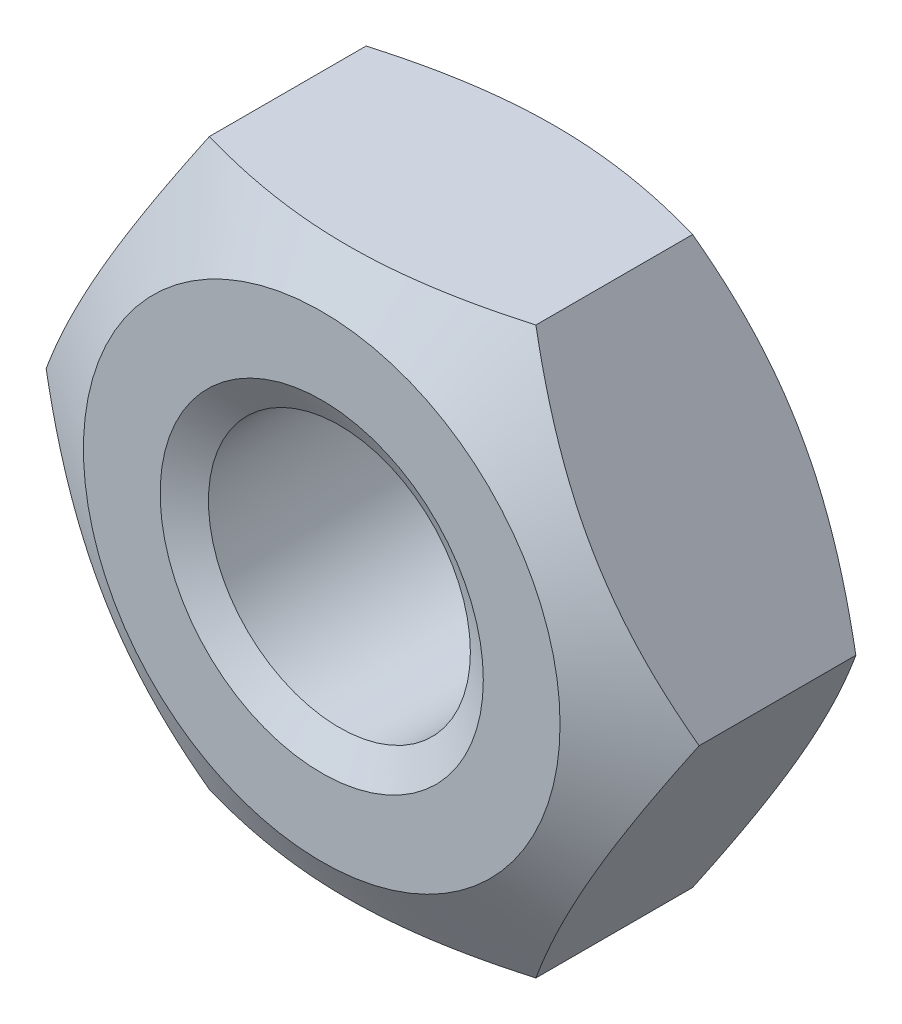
ISO-10303-21;
HEADER;
FILE_DESCRIPTION(('STEP AP214'),'2;1');
FILE_NAME('part.step','',(''),(''),'','','');
FILE_SCHEMA(('AUTOMOTIVE_DESIGN { 1 0 10303 214 1 1 1 1 }'));
ENDSEC;
DATA;
#1=APPLICATION_CONTEXT('core data for automotive mechanical design processes');
#2=APPLICATION_PROTOCOL_DEFINITION('international standard','automotive_design',2000,#1);
#3=PRODUCT_CONTEXT('',#1,'mechanical');
#4=PRODUCT('Part','Part','',(#3));
#5=PRODUCT_RELATED_PRODUCT_CATEGORY('part','',(#4));
#6=PRODUCT_DEFINITION_FORMATION('','',#4);
#7=PRODUCT_DEFINITION_CONTEXT('part definition',#1,'design');
#8=PRODUCT_DEFINITION('design','',#6,#7);
#9=PRODUCT_DEFINITION_SHAPE('','',#8);
#10=(LENGTH_UNIT() NAMED_UNIT(*) SI_UNIT(.MILLI.,.METRE.));
#11=(NAMED_UNIT(*) PLANE_ANGLE_UNIT() SI_UNIT($,.RADIAN.));
#12=(NAMED_UNIT(*) SI_UNIT($,.STERADIAN.) SOLID_ANGLE_UNIT());
#13=UNCERTAINTY_MEASURE_WITH_UNIT(LENGTH_MEASURE(1.E-05),#10,'distance_accuracy_value','');
#14=(GEOMETRIC_REPRESENTATION_CONTEXT(3) GLOBAL_UNCERTAINTY_ASSIGNED_CONTEXT((#13)) GLOBAL_UNIT_ASSIGNED_CONTEXT((#10,
#11,#12)) REPRESENTATION_CONTEXT('',''));
#15=CARTESIAN_POINT('',(0.,0.,0.));
#16=DIRECTION('',(0.,0.,1.));
#17=DIRECTION('',(1.,0.,0.));
#18=AXIS2_PLACEMENT_3D('',#15,#16,#17);
#19=CARTESIAN_POINT('',(-3.03108891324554,1.75,3.2));
#20=DIRECTION('',(-0.866025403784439,0.5,0.));
#21=DIRECTION('',(0.5,0.866025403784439,0.));
#22=AXIS2_PLACEMENT_3D('',#19,#20,#21);
#23=PLANE('',#22);
#24=CARTESIAN_POINT('',(-4.04145188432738,0.,0.630150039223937));
#25=CARTESIAN_POINT('',(-3.03108891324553,1.75,0.0468167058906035));
#26=CARTESIAN_POINT('',(-2.02072594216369,3.5,0.630150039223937));
#27=(BOUNDED_CURVE() B_SPLINE_CURVE(2,(#24,#25,#26),.UNSPECIFIED.,.F.,
.F.) B_SPLINE_CURVE_WITH_KNOTS((3,3),(0.,4.08952648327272),
.UNSPECIFIED.) CURVE() GEOMETRIC_REPRESENTATION_ITEM() RATIONAL_B_SPLINE_CURVE((1.,
1.15470053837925,1.)) REPRESENTATION_ITEM(''));
#28=CARTESIAN_POINT('',(-4.04145188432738,0.,0.630150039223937));
#29=VERTEX_POINT('',#28);
#30=CARTESIAN_POINT('',(-2.02072594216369,3.5,0.630150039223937));
#31=VERTEX_POINT('',#30);
#32=EDGE_CURVE('E159',#29,#31,#27,.T.);
#33=ORIENTED_EDGE('',*,*,#32,.F.);
#34=DIRECTION('',(0.,0.,-1.));
#35=VECTOR('',#34,1.);
#36=CARTESIAN_POINT('',(-4.04145188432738,0.,3.2));
#37=LINE('',#36,#35);
#38=CARTESIAN_POINT('',(-4.04145188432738,0.,2.56984996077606));
#39=VERTEX_POINT('',#38);
#40=EDGE_CURVE('E77',#39,#29,#37,.T.);
#41=ORIENTED_EDGE('',*,*,#40,.F.);
#42=CARTESIAN_POINT('',(-2.02072594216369,3.5,2.56984996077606));
#43=CARTESIAN_POINT('',(-3.03108891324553,1.75,3.1531832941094));
#44=CARTESIAN_POINT('',(-4.04145188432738,0.,2.56984996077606));
#45=(BOUNDED_CURVE() B_SPLINE_CURVE(2,(#42,#43,#44),.UNSPECIFIED.,.F.,
.F.) B_SPLINE_CURVE_WITH_KNOTS((3,3),(0.,4.08952648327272),
.UNSPECIFIED.) CURVE() GEOMETRIC_REPRESENTATION_ITEM() RATIONAL_B_SPLINE_CURVE((1.,
1.15470053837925,1.)) REPRESENTATION_ITEM(''));
#46=CARTESIAN_POINT('',(-2.02072594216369,3.5,2.56984996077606));
#47=VERTEX_POINT('',#46);
#48=EDGE_CURVE('E91',#47,#39,#45,.T.);
#49=ORIENTED_EDGE('',*,*,#48,.F.);
#50=DIRECTION('',(0.,0.,-1.));
#51=VECTOR('',#50,1.);
#52=CARTESIAN_POINT('',(-2.02072594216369,3.5,3.2));
#53=LINE('',#52,#51);
#54=EDGE_CURVE('E10',#47,#31,#53,.T.);
#55=ORIENTED_EDGE('',*,*,#54,.T.);
#56=EDGE_LOOP('',(#33,#41,#49,#55));
#57=FACE_BOUND('',#56,.T.);
#58=ADVANCED_FACE('F15',(#57),#23,.T.);
#59=CARTESIAN_POINT('',(0.,3.5,3.2));
#60=DIRECTION('',(0.,1.,0.));
#61=DIRECTION('',(1.,0.,0.));
#62=AXIS2_PLACEMENT_3D('',#59,#60,#61);
#63=PLANE('',#62);
#64=CARTESIAN_POINT('',(-2.02072594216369,3.5,0.630150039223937));
#65=CARTESIAN_POINT('',(0.,3.5,0.046816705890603));
#66=CARTESIAN_POINT('',(2.02072594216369,3.5,0.630150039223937));
#67=(BOUNDED_CURVE() B_SPLINE_CURVE(2,(#64,#65,#66),.UNSPECIFIED.,.F.,
.F.) B_SPLINE_CURVE_WITH_KNOTS((3,3),(0.,4.08952648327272),
.UNSPECIFIED.) CURVE() GEOMETRIC_REPRESENTATION_ITEM() RATIONAL_B_SPLINE_CURVE((1.,
1.15470053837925,1.)) REPRESENTATION_ITEM(''));
#68=CARTESIAN_POINT('',(2.02072594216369,3.5,0.630150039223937));
#69=VERTEX_POINT('',#68);
#70=EDGE_CURVE('E88',#31,#69,#67,.T.);
#71=ORIENTED_EDGE('',*,*,#70,.F.);
#72=ORIENTED_EDGE('',*,*,#54,.F.);
#73=CARTESIAN_POINT('',(2.02072594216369,3.5,2.56984996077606));
#74=CARTESIAN_POINT('',(0.,3.5,3.1531832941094));
#75=CARTESIAN_POINT('',(-2.02072594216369,3.5,2.56984996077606));
#76=(BOUNDED_CURVE() B_SPLINE_CURVE(2,(#73,#74,#75),.UNSPECIFIED.,.F.,
.F.) B_SPLINE_CURVE_WITH_KNOTS((3,3),(0.,4.08952648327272),
.UNSPECIFIED.) CURVE() GEOMETRIC_REPRESENTATION_ITEM() RATIONAL_B_SPLINE_CURVE((1.,
1.15470053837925,1.)) REPRESENTATION_ITEM(''));
#77=CARTESIAN_POINT('',(2.02072594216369,3.5,2.56984996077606));
#78=VERTEX_POINT('',#77);
#79=EDGE_CURVE('E85',#78,#47,#76,.T.);
#80=ORIENTED_EDGE('',*,*,#79,.F.);
#81=DIRECTION('',(0.,0.,-1.));
#82=VECTOR('',#81,1.);
#83=CARTESIAN_POINT('',(2.02072594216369,3.5,3.2));
#84=LINE('',#83,#82);
#85=EDGE_CURVE('E25',#78,#69,#84,.T.);
#86=ORIENTED_EDGE('',*,*,#85,.T.);
#87=EDGE_LOOP('',(#71,#72,#80,#86));
#88=FACE_BOUND('',#87,.T.);
#89=ADVANCED_FACE('F83',(#88),#63,.T.);
#90=CARTESIAN_POINT('',(0.,0.,0.));
#91=DIRECTION('',(0.,0.,-1.));
#92=DIRECTION('',(0.,1.,0.));
#93=AXIS2_PLACEMENT_3D('',#90,#91,#92);
#94=PLANE('',#93);
#95=CARTESIAN_POINT('',(0.,0.,0.));
#96=DIRECTION('',(0.,0.,1.));
#97=DIRECTION('',(1.,0.,0.));
#98=AXIS2_PLACEMENT_3D('',#95,#96,#97);
#99=CIRCLE('',#98,2.95);
#100=CARTESIAN_POINT('',(2.95,0.,0.));
#101=VERTEX_POINT('',#100);
#102=EDGE_CURVE('E32',#101,#101,#99,.T.);
#103=ORIENTED_EDGE('',*,*,#102,.F.);
#104=EDGE_LOOP('',(#103));
#105=FACE_BOUND('',#104,.T.);
#106=CARTESIAN_POINT('',(0.,0.,0.));
#107=DIRECTION('',(0.,0.,1.));
#108=DIRECTION('',(1.,0.,0.));
#109=AXIS2_PLACEMENT_3D('',#106,#107,#108);
#110=CIRCLE('',#109,2.);
#111=CARTESIAN_POINT('',(2.,0.,0.));
#112=VERTEX_POINT('',#111);
#113=EDGE_CURVE('E101',#112,#112,#110,.T.);
#114=ORIENTED_EDGE('',*,*,#113,.T.);
#115=EDGE_LOOP('',(#114));
#116=FACE_BOUND('',#115,.T.);
#117=ADVANCED_FACE('F17',(#105,#116),#94,.T.);
#118=CARTESIAN_POINT('',(0.,0.,3.2));
#119=DIRECTION('',(0.,0.,-1.));
#120=DIRECTION('',(0.,1.,0.));
#121=AXIS2_PLACEMENT_3D('',#118,#119,#120);
#122=PLANE('',#121);
#123=CARTESIAN_POINT('',(0.,0.,3.2));
#124=DIRECTION('',(0.,0.,-1.));
#125=DIRECTION('',(1.,0.,0.));
#126=AXIS2_PLACEMENT_3D('',#123,#124,#125);
#127=CIRCLE('',#126,2.95);
#128=CARTESIAN_POINT('',(2.95,0.,3.2));
#129=VERTEX_POINT('',#128);
#130=EDGE_CURVE('E107',#129,#129,#127,.T.);
#131=ORIENTED_EDGE('',*,*,#130,.F.);
#132=EDGE_LOOP('',(#131));
#133=FACE_BOUND('',#132,.T.);
#134=CARTESIAN_POINT('',(0.,0.,3.2));
#135=DIRECTION('',(0.,0.,-1.));
#136=DIRECTION('',(1.,0.,0.));
#137=AXIS2_PLACEMENT_3D('',#134,#135,#136);
#138=CIRCLE('',#137,2.);
#139=CARTESIAN_POINT('',(2.,0.,3.2));
#140=VERTEX_POINT('',#139);
#141=EDGE_CURVE('E109',#140,#140,#138,.T.);
#142=ORIENTED_EDGE('',*,*,#141,.T.);
#143=EDGE_LOOP('',(#142));
#144=FACE_BOUND('',#143,.T.);
#145=ADVANCED_FACE('F256',(#133,#144),#122,.F.);
#146=CARTESIAN_POINT('',(3.03108891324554,1.75,3.2));
#147=DIRECTION('',(0.866025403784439,0.5,0.));
#148=DIRECTION('',(0.5,-0.866025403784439,0.));
#149=AXIS2_PLACEMENT_3D('',#146,#147,#148);
#150=PLANE('',#149);
#151=CARTESIAN_POINT('',(2.02072594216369,3.5,0.630150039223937));
#152=CARTESIAN_POINT('',(3.03108891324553,1.75,0.0468167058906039));
#153=CARTESIAN_POINT('',(4.04145188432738,0.,0.630150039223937));
#154=(BOUNDED_CURVE() B_SPLINE_CURVE(2,(#151,#152,#153),.UNSPECIFIED.,.F.,
.F.) B_SPLINE_CURVE_WITH_KNOTS((3,3),(0.,4.08952648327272),
.UNSPECIFIED.) CURVE() GEOMETRIC_REPRESENTATION_ITEM() RATIONAL_B_SPLINE_CURVE((1.,
1.15470053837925,1.)) REPRESENTATION_ITEM(''));
#155=CARTESIAN_POINT('',(4.04145188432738,0.,0.630150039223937));
#156=VERTEX_POINT('',#155);
#157=EDGE_CURVE('E135',#69,#156,#154,.T.);
#158=ORIENTED_EDGE('',*,*,#157,.F.);
#159=ORIENTED_EDGE('',*,*,#85,.F.);
#160=CARTESIAN_POINT('',(4.04145188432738,0.,2.56984996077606));
#161=CARTESIAN_POINT('',(3.03108891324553,1.75,3.1531832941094));
#162=CARTESIAN_POINT('',(2.02072594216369,3.5,2.56984996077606));
#163=(BOUNDED_CURVE() B_SPLINE_CURVE(2,(#160,#161,#162),.UNSPECIFIED.,.F.,
.F.) B_SPLINE_CURVE_WITH_KNOTS((3,3),(0.,4.08952648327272),
.UNSPECIFIED.) CURVE() GEOMETRIC_REPRESENTATION_ITEM() RATIONAL_B_SPLINE_CURVE((1.,
1.15470053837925,1.)) REPRESENTATION_ITEM(''));
#164=CARTESIAN_POINT('',(4.04145188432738,0.,2.56984996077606));
#165=VERTEX_POINT('',#164);
#166=EDGE_CURVE('E99',#165,#78,#163,.T.);
#167=ORIENTED_EDGE('',*,*,#166,.F.);
#168=DIRECTION('',(0.,0.,-1.));
#169=VECTOR('',#168,1.);
#170=CARTESIAN_POINT('',(4.04145188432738,0.,3.2));
#171=LINE('',#170,#169);
#172=EDGE_CURVE('E125',#165,#156,#171,.T.);
#173=ORIENTED_EDGE('',*,*,#172,.T.);
#174=EDGE_LOOP('',(#158,#159,#167,#173));
#175=FACE_BOUND('',#174,.T.);
#176=ADVANCED_FACE('F258',(#175),#150,.T.);
#177=CARTESIAN_POINT('',(3.03108891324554,-1.75,3.2));
#178=DIRECTION('',(0.866025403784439,-0.5,0.));
#179=DIRECTION('',(-0.5,-0.866025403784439,0.));
#180=AXIS2_PLACEMENT_3D('',#177,#178,#179);
#181=PLANE('',#180);
#182=CARTESIAN_POINT('',(4.04145188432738,0.,0.630150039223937));
#183=CARTESIAN_POINT('',(3.03108891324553,-1.75,0.0468167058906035));
#184=CARTESIAN_POINT('',(2.02072594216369,-3.5,0.630150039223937));
#185=(BOUNDED_CURVE() B_SPLINE_CURVE(2,(#182,#183,#184),.UNSPECIFIED.,.F.,
.F.) B_SPLINE_CURVE_WITH_KNOTS((3,3),(0.,4.08952648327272),
.UNSPECIFIED.) CURVE() GEOMETRIC_REPRESENTATION_ITEM() RATIONAL_B_SPLINE_CURVE((1.,
1.15470053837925,1.)) REPRESENTATION_ITEM(''));
#186=CARTESIAN_POINT('',(2.02072594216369,-3.5,0.630150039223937));
#187=VERTEX_POINT('',#186);
#188=EDGE_CURVE('E121',#156,#187,#185,.T.);
#189=ORIENTED_EDGE('',*,*,#188,.F.);
#190=ORIENTED_EDGE('',*,*,#172,.F.);
#191=CARTESIAN_POINT('',(2.02072594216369,-3.5,2.56984996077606));
#192=CARTESIAN_POINT('',(3.03108891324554,-1.75,3.1531832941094));
#193=CARTESIAN_POINT('',(4.04145188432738,0.,2.56984996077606));
#194=(BOUNDED_CURVE() B_SPLINE_CURVE(2,(#191,#192,#193),.UNSPECIFIED.,.F.,
.F.) B_SPLINE_CURVE_WITH_KNOTS((3,3),(0.,4.08952648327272),
.UNSPECIFIED.) CURVE() GEOMETRIC_REPRESENTATION_ITEM() RATIONAL_B_SPLINE_CURVE((1.,
1.15470053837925,1.)) REPRESENTATION_ITEM(''));
#195=CARTESIAN_POINT('',(2.02072594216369,-3.5,2.56984996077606));
#196=VERTEX_POINT('',#195);
#197=EDGE_CURVE('E126',#196,#165,#194,.T.);
#198=ORIENTED_EDGE('',*,*,#197,.F.);
#199=DIRECTION('',(0.,0.,-1.));
#200=VECTOR('',#199,1.);
#201=CARTESIAN_POINT('',(2.02072594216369,-3.5,3.2));
#202=LINE('',#201,#200);
#203=EDGE_CURVE('E143',#196,#187,#202,.T.);
#204=ORIENTED_EDGE('',*,*,#203,.T.);
#205=EDGE_LOOP('',(#189,#190,#198,#204));
#206=FACE_BOUND('',#205,.T.);
#207=ADVANCED_FACE('F264',(#206),#181,.T.);
#208=CARTESIAN_POINT('',(0.,-3.5,3.2));
#209=DIRECTION('',(0.,-1.,0.));
#210=DIRECTION('',(-1.,0.,0.));
#211=AXIS2_PLACEMENT_3D('',#208,#209,#210);
#212=PLANE('',#211);
#213=CARTESIAN_POINT('',(2.02072594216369,-3.5,0.630150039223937));
#214=CARTESIAN_POINT('',(0.,-3.5,0.0468167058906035));
#215=CARTESIAN_POINT('',(-2.02072594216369,-3.5,0.630150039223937));
#216=(BOUNDED_CURVE() B_SPLINE_CURVE(2,(#213,#214,#215),.UNSPECIFIED.,.F.,
.F.) B_SPLINE_CURVE_WITH_KNOTS((3,3),(0.,4.08952648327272),
.UNSPECIFIED.) CURVE() GEOMETRIC_REPRESENTATION_ITEM() RATIONAL_B_SPLINE_CURVE((1.,
1.15470053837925,1.)) REPRESENTATION_ITEM(''));
#217=CARTESIAN_POINT('',(-2.02072594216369,-3.5,0.630150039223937));
#218=VERTEX_POINT('',#217);
#219=EDGE_CURVE('E115',#187,#218,#216,.T.);
#220=ORIENTED_EDGE('',*,*,#219,.F.);
#221=ORIENTED_EDGE('',*,*,#203,.F.);
#222=CARTESIAN_POINT('',(-2.02072594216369,-3.5,2.56984996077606));
#223=CARTESIAN_POINT('',(0.,-3.5,3.1531832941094));
#224=CARTESIAN_POINT('',(2.02072594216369,-3.5,2.56984996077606));
#225=(BOUNDED_CURVE() B_SPLINE_CURVE(2,(#222,#223,#224),.UNSPECIFIED.,.F.,
.F.) B_SPLINE_CURVE_WITH_KNOTS((3,3),(0.,4.08952648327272),
.UNSPECIFIED.) CURVE() GEOMETRIC_REPRESENTATION_ITEM() RATIONAL_B_SPLINE_CURVE((1.,
1.15470053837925,1.)) REPRESENTATION_ITEM(''));
#226=CARTESIAN_POINT('',(-2.02072594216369,-3.5,2.56984996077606));
#227=VERTEX_POINT('',#226);
#228=EDGE_CURVE('E129',#227,#196,#225,.T.);
#229=ORIENTED_EDGE('',*,*,#228,.F.);
#230=DIRECTION('',(0.,0.,-1.));
#231=VECTOR('',#230,1.);
#232=CARTESIAN_POINT('',(-2.02072594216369,-3.5,3.2));
#233=LINE('',#232,#231);
#234=EDGE_CURVE('E155',#227,#218,#233,.T.);
#235=ORIENTED_EDGE('',*,*,#234,.T.);
#236=EDGE_LOOP('',(#220,#221,#229,#235));
#237=FACE_BOUND('',#236,.T.);
#238=ADVANCED_FACE('F180',(#237),#212,.T.);
#239=CARTESIAN_POINT('',(-3.03108891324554,-1.75,3.2));
#240=DIRECTION('',(-0.866025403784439,-0.5,0.));
#241=DIRECTION('',(-0.5,0.866025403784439,0.));
#242=AXIS2_PLACEMENT_3D('',#239,#240,#241);
#243=PLANE('',#242);
#244=CARTESIAN_POINT('',(-2.02072594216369,-3.5,0.630150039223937));
#245=CARTESIAN_POINT('',(-3.03108891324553,-1.75,0.0468167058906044));
#246=CARTESIAN_POINT('',(-4.04145188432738,0.,0.630150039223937));
#247=(BOUNDED_CURVE() B_SPLINE_CURVE(2,(#244,#245,#246),.UNSPECIFIED.,.F.,
.F.) B_SPLINE_CURVE_WITH_KNOTS((3,3),(0.,4.08952648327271),
.UNSPECIFIED.) CURVE() GEOMETRIC_REPRESENTATION_ITEM() RATIONAL_B_SPLINE_CURVE((1.,
1.15470053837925,1.)) REPRESENTATION_ITEM(''));
#248=EDGE_CURVE('E120',#218,#29,#247,.T.);
#249=ORIENTED_EDGE('',*,*,#248,.F.);
#250=ORIENTED_EDGE('',*,*,#234,.F.);
#251=CARTESIAN_POINT('',(-4.04145188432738,0.,2.56984996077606));
#252=CARTESIAN_POINT('',(-3.03108891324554,-1.75,3.15318329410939));
#253=CARTESIAN_POINT('',(-2.02072594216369,-3.5,2.56984996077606));
#254=(BOUNDED_CURVE() B_SPLINE_CURVE(2,(#251,#252,#253),.UNSPECIFIED.,.F.,
.F.) B_SPLINE_CURVE_WITH_KNOTS((3,3),(0.,4.08952648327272),
.UNSPECIFIED.) CURVE() GEOMETRIC_REPRESENTATION_ITEM() RATIONAL_B_SPLINE_CURVE((1.,
1.15470053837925,1.)) REPRESENTATION_ITEM(''));
#255=EDGE_CURVE('E94',#39,#227,#254,.T.);
#256=ORIENTED_EDGE('',*,*,#255,.F.);
#257=ORIENTED_EDGE('',*,*,#40,.T.);
#258=EDGE_LOOP('',(#249,#250,#256,#257));
#259=FACE_BOUND('',#258,.T.);
#260=ADVANCED_FACE('F185',(#259),#243,.T.);
#261=CARTESIAN_POINT('',(0.,0.,0.315075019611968));
#262=DIRECTION('',(0.,0.,1.));
#263=DIRECTION('',(1.,0.,0.));
#264=AXIS2_PLACEMENT_3D('',#261,#262,#263);
#265=CONICAL_SURFACE('',#264,3.49572594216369,1.0471975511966);
#266=ORIENTED_EDGE('',*,*,#102,.T.);
#267=EDGE_LOOP('',(#266));
#268=FACE_BOUND('',#267,.T.);
#269=ORIENTED_EDGE('',*,*,#157,.T.);
#270=ORIENTED_EDGE('',*,*,#188,.T.);
#271=ORIENTED_EDGE('',*,*,#219,.T.);
#272=ORIENTED_EDGE('',*,*,#248,.T.);
#273=ORIENTED_EDGE('',*,*,#32,.T.);
#274=ORIENTED_EDGE('',*,*,#70,.T.);
#275=EDGE_LOOP('',(#269,#270,#271,#272,#273,#274));
#276=FACE_BOUND('',#275,.T.);
#277=ADVANCED_FACE('F187',(#268,#276),#265,.T.);
#278=CARTESIAN_POINT('',(0.,0.,2.88492498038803));
#279=DIRECTION('',(0.,0.,-1.));
#280=DIRECTION('',(1.,0.,0.));
#281=AXIS2_PLACEMENT_3D('',#278,#279,#280);
#282=CONICAL_SURFACE('',#281,3.49572594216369,1.0471975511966);
#283=ORIENTED_EDGE('',*,*,#130,.T.);
#284=EDGE_LOOP('',(#283));
#285=FACE_BOUND('',#284,.T.);
#286=ORIENTED_EDGE('',*,*,#166,.T.);
#287=ORIENTED_EDGE('',*,*,#79,.T.);
#288=ORIENTED_EDGE('',*,*,#48,.T.);
#289=ORIENTED_EDGE('',*,*,#255,.T.);
#290=ORIENTED_EDGE('',*,*,#228,.T.);
#291=ORIENTED_EDGE('',*,*,#197,.T.);
#292=EDGE_LOOP('',(#286,#287,#288,#289,#290,#291));
#293=FACE_BOUND('',#292,.T.);
#294=ADVANCED_FACE('F96',(#285,#293),#282,.T.);
#295=CARTESIAN_POINT('',(0.,0.,0.10937179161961));
#296=DIRECTION('',(0.,0.,-1.));
#297=DIRECTION('',(1.,0.,0.));
#298=AXIS2_PLACEMENT_3D('',#295,#296,#297);
#299=CONICAL_SURFACE('',#298,1.8105625,1.0471975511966);
#300=CARTESIAN_POINT('',(0.,0.,0.218743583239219));
#301=DIRECTION('',(0.,0.,-1.));
#302=DIRECTION('',(1.,0.,0.));
#303=AXIS2_PLACEMENT_3D('',#300,#301,#302);
#304=CIRCLE('',#303,1.621125);
#305=CARTESIAN_POINT('',(1.621125,0.,0.218743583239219));
#306=VERTEX_POINT('',#305);
#307=EDGE_CURVE('E114',#306,#306,#304,.T.);
#308=ORIENTED_EDGE('',*,*,#307,.F.);
#309=EDGE_LOOP('',(#308));
#310=FACE_BOUND('',#309,.T.);
#311=ORIENTED_EDGE('',*,*,#113,.F.);
#312=EDGE_LOOP('',(#311));
#313=FACE_BOUND('',#312,.T.);
#314=ADVANCED_FACE('F219',(#310,#313),#299,.F.);
#315=CARTESIAN_POINT('',(0.,0.,1.6));
#316=DIRECTION('',(0.,0.,1.));
#317=DIRECTION('',(1.,0.,0.));
#318=AXIS2_PLACEMENT_3D('',#315,#316,#317);
#319=CYLINDRICAL_SURFACE('',#318,1.621125);
#320=CARTESIAN_POINT('',(0.,0.,2.98125641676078));
#321=DIRECTION('',(0.,0.,-1.));
#322=DIRECTION('',(1.,0.,0.));
#323=AXIS2_PLACEMENT_3D('',#320,#321,#322);
#324=CIRCLE('',#323,1.621125);
#325=CARTESIAN_POINT('',(1.621125,0.,2.98125641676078));
#326=VERTEX_POINT('',#325);
#327=EDGE_CURVE('E19',#326,#326,#324,.T.);
#328=ORIENTED_EDGE('',*,*,#327,.F.);
#329=EDGE_LOOP('',(#328));
#330=FACE_BOUND('',#329,.T.);
#331=ORIENTED_EDGE('',*,*,#307,.T.);
#332=EDGE_LOOP('',(#331));
#333=FACE_BOUND('',#332,.T.);
#334=ADVANCED_FACE('F221',(#330,#333),#319,.F.);
#335=CARTESIAN_POINT('',(0.,0.,3.09062820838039));
#336=DIRECTION('',(0.,0.,1.));
#337=DIRECTION('',(1.,0.,0.));
#338=AXIS2_PLACEMENT_3D('',#335,#336,#337);
#339=CONICAL_SURFACE('',#338,1.8105625,1.0471975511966);
#340=ORIENTED_EDGE('',*,*,#141,.F.);
#341=EDGE_LOOP('',(#340));
#342=FACE_BOUND('',#341,.T.);
#343=ORIENTED_EDGE('',*,*,#327,.T.);
#344=EDGE_LOOP('',(#343));
#345=FACE_BOUND('',#344,.T.);
#346=ADVANCED_FACE('F229',(#342,#345),#339,.F.);
#347=CLOSED_SHELL('',(#58,#89,#117,#145,#176,#207,#238,#260,#277,#294,#314,#334,#346));
#348=MANIFOLD_SOLID_BREP('B1',#347);
#349=ADVANCED_BREP_SHAPE_REPRESENTATION('',(#18,#348),#14);
#350=SHAPE_DEFINITION_REPRESENTATION(#9,#349);
ENDSEC;
END-ISO-10303-21;
